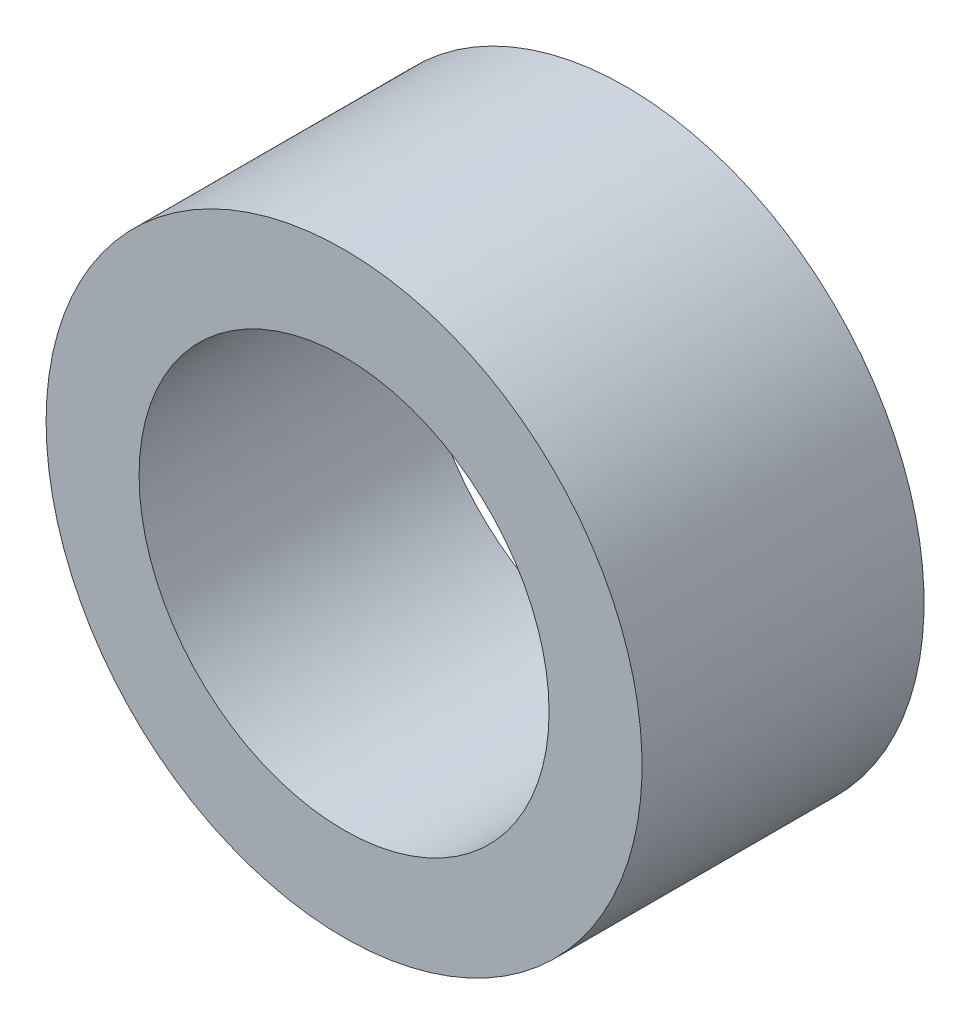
ISO-10303-21;
HEADER;
FILE_DESCRIPTION(('STEP AP214'),'2;1');
FILE_NAME('part.step','',(''),(''),'','','');
FILE_SCHEMA(('AUTOMOTIVE_DESIGN { 1 0 10303 214 1 1 1 1 }'));
ENDSEC;
DATA;
#1=APPLICATION_CONTEXT('core data for automotive mechanical design processes');
#2=APPLICATION_PROTOCOL_DEFINITION('international standard','automotive_design',2000,#1);
#3=PRODUCT_CONTEXT('',#1,'mechanical');
#4=PRODUCT('Part','Part','',(#3));
#5=PRODUCT_RELATED_PRODUCT_CATEGORY('part','',(#4));
#6=PRODUCT_DEFINITION_FORMATION('','',#4);
#7=PRODUCT_DEFINITION_CONTEXT('part definition',#1,'design');
#8=PRODUCT_DEFINITION('design','',#6,#7);
#9=PRODUCT_DEFINITION_SHAPE('','',#8);
#10=(LENGTH_UNIT() NAMED_UNIT(*) SI_UNIT(.MILLI.,.METRE.));
#11=(NAMED_UNIT(*) PLANE_ANGLE_UNIT() SI_UNIT($,.RADIAN.));
#12=(NAMED_UNIT(*) SI_UNIT($,.STERADIAN.) SOLID_ANGLE_UNIT());
#13=UNCERTAINTY_MEASURE_WITH_UNIT(LENGTH_MEASURE(1.E-05),#10,'distance_accuracy_value','');
#14=(GEOMETRIC_REPRESENTATION_CONTEXT(3) GLOBAL_UNCERTAINTY_ASSIGNED_CONTEXT((#13)) GLOBAL_UNIT_ASSIGNED_CONTEXT((#10,
#11,#12)) REPRESENTATION_CONTEXT('',''));
#15=CARTESIAN_POINT('',(0.,0.,0.));
#16=DIRECTION('',(0.,0.,1.));
#17=DIRECTION('',(1.,0.,0.));
#18=AXIS2_PLACEMENT_3D('',#15,#16,#17);
#19=CARTESIAN_POINT('',(0.,0.,0.));
#20=DIRECTION('',(0.,0.,-1.));
#21=DIRECTION('',(-1.,0.,0.));
#22=AXIS2_PLACEMENT_3D('',#19,#20,#21);
#23=CYLINDRICAL_SURFACE('',#22,182.87711847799);
#24=CARTESIAN_POINT('',(0.,0.,250.83790469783));
#25=DIRECTION('',(0.,0.,-1.));
#26=DIRECTION('',(-1.,0.,0.));
#27=AXIS2_PLACEMENT_3D('',#24,#25,#26);
#28=CIRCLE('',#27,182.87711847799);
#29=CARTESIAN_POINT('',(-182.87711847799,0.,250.83790469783));
#30=VERTEX_POINT('',#29);
#31=EDGE_CURVE('E10',#30,#30,#28,.T.);
#32=ORIENTED_EDGE('',*,*,#31,.F.);
#33=EDGE_LOOP('',(#32));
#34=FACE_BOUND('',#33,.T.);
#35=CARTESIAN_POINT('',(0.,0.,-0.753016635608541));
#36=DIRECTION('',(0.,0.,-1.));
#37=DIRECTION('',(-1.,0.,0.));
#38=AXIS2_PLACEMENT_3D('',#35,#36,#37);
#39=CIRCLE('',#38,182.87711847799);
#40=CARTESIAN_POINT('',(-182.87711847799,0.,-0.753016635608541));
#41=VERTEX_POINT('',#40);
#42=EDGE_CURVE('E51',#41,#41,#39,.T.);
#43=ORIENTED_EDGE('',*,*,#42,.T.);
#44=EDGE_LOOP('',(#43));
#45=FACE_BOUND('',#44,.T.);
#46=ADVANCED_FACE('F37',(#34,#45),#23,.F.);
#47=CARTESIAN_POINT('',(182.87711847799,0.,250.83790469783));
#48=DIRECTION('',(0.,0.,-1.));
#49=DIRECTION('',(-1.,0.,0.));
#50=AXIS2_PLACEMENT_3D('',#47,#48,#49);
#51=PLANE('',#50);
#52=CARTESIAN_POINT('',(0.,0.,250.83790469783));
#53=DIRECTION('',(0.,0.,-1.));
#54=DIRECTION('',(-1.,0.,0.));
#55=AXIS2_PLACEMENT_3D('',#52,#53,#54);
#56=CIRCLE('',#55,265.818104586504);
#57=CARTESIAN_POINT('',(-265.818104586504,0.,250.83790469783));
#58=VERTEX_POINT('',#57);
#59=EDGE_CURVE('E43',#58,#58,#56,.T.);
#60=ORIENTED_EDGE('',*,*,#59,.F.);
#61=EDGE_LOOP('',(#60));
#62=FACE_BOUND('',#61,.T.);
#63=ORIENTED_EDGE('',*,*,#31,.T.);
#64=EDGE_LOOP('',(#63));
#65=FACE_BOUND('',#64,.T.);
#66=ADVANCED_FACE('F66',(#62,#65),#51,.F.);
#67=CARTESIAN_POINT('',(0.,0.,0.));
#68=DIRECTION('',(0.,0.,-1.));
#69=DIRECTION('',(-1.,0.,0.));
#70=AXIS2_PLACEMENT_3D('',#67,#68,#69);
#71=CYLINDRICAL_SURFACE('',#70,265.818104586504);
#72=CARTESIAN_POINT('',(0.,0.,-0.753016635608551));
#73=DIRECTION('',(0.,0.,-1.));
#74=DIRECTION('',(-1.,0.,0.));
#75=AXIS2_PLACEMENT_3D('',#72,#73,#74);
#76=CIRCLE('',#75,265.818104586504);
#77=CARTESIAN_POINT('',(-265.818104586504,0.,-0.753016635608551));
#78=VERTEX_POINT('',#77);
#79=EDGE_CURVE('E47',#78,#78,#76,.T.);
#80=ORIENTED_EDGE('',*,*,#79,.F.);
#81=EDGE_LOOP('',(#80));
#82=FACE_BOUND('',#81,.T.);
#83=ORIENTED_EDGE('',*,*,#59,.T.);
#84=EDGE_LOOP('',(#83));
#85=FACE_BOUND('',#84,.T.);
#86=ADVANCED_FACE('F61',(#82,#85),#71,.T.);
#87=CARTESIAN_POINT('',(182.87711847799,0.,-0.753016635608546));
#88=DIRECTION('',(0.,0.,1.));
#89=DIRECTION('',(1.,0.,0.));
#90=AXIS2_PLACEMENT_3D('',#87,#88,#89);
#91=PLANE('',#90);
#92=ORIENTED_EDGE('',*,*,#42,.F.);
#93=EDGE_LOOP('',(#92));
#94=FACE_BOUND('',#93,.T.);
#95=ORIENTED_EDGE('',*,*,#79,.T.);
#96=EDGE_LOOP('',(#95));
#97=FACE_BOUND('',#96,.T.);
#98=ADVANCED_FACE('F58',(#94,#97),#91,.F.);
#99=CLOSED_SHELL('',(#46,#66,#86,#98));
#100=MANIFOLD_SOLID_BREP('B2',#99);
#101=ADVANCED_BREP_SHAPE_REPRESENTATION('',(#18,#100),#14);
#102=SHAPE_DEFINITION_REPRESENTATION(#9,#101);
ENDSEC;
END-ISO-10303-21;
